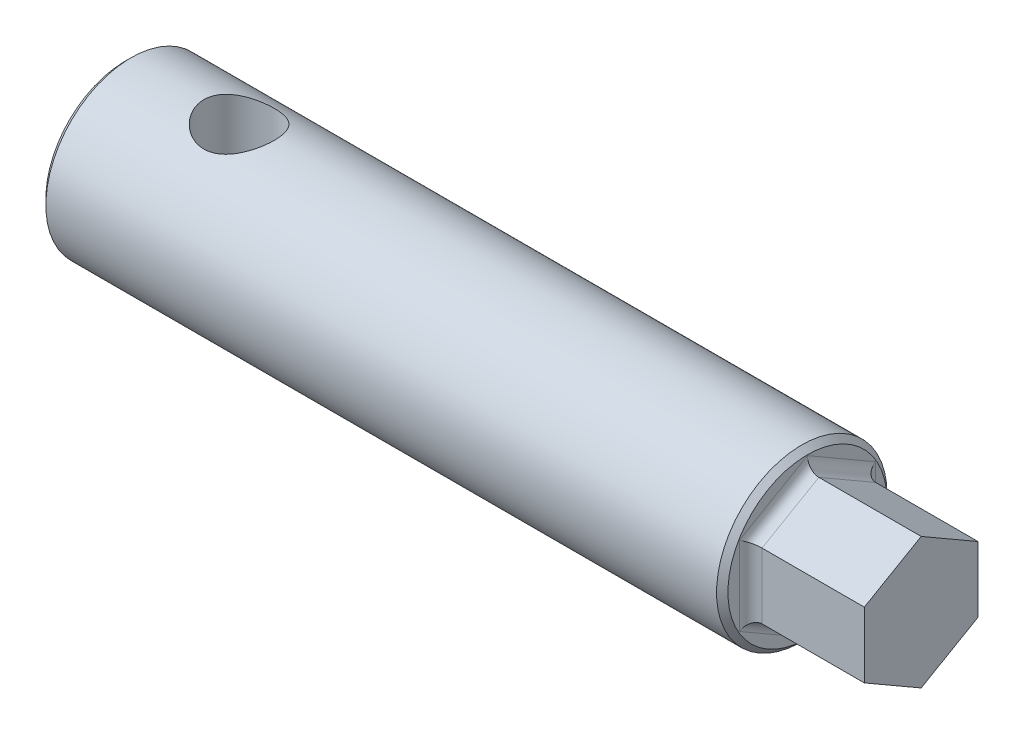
ISO-10303-21;
HEADER;
FILE_DESCRIPTION(('STEP AP214'),'2;1');
FILE_NAME('part.step','',(''),(''),'','','');
FILE_SCHEMA(('AUTOMOTIVE_DESIGN { 1 0 10303 214 1 1 1 1 }'));
ENDSEC;
DATA;
#1=APPLICATION_CONTEXT('core data for automotive mechanical design processes');
#2=APPLICATION_PROTOCOL_DEFINITION('international standard','automotive_design',2000,#1);
#3=PRODUCT_CONTEXT('',#1,'mechanical');
#4=PRODUCT('Part','Part','',(#3));
#5=PRODUCT_RELATED_PRODUCT_CATEGORY('part','',(#4));
#6=PRODUCT_DEFINITION_FORMATION('','',#4);
#7=PRODUCT_DEFINITION_CONTEXT('part definition',#1,'design');
#8=PRODUCT_DEFINITION('design','',#6,#7);
#9=PRODUCT_DEFINITION_SHAPE('','',#8);
#10=(LENGTH_UNIT() NAMED_UNIT(*) SI_UNIT(.MILLI.,.METRE.));
#11=(NAMED_UNIT(*) PLANE_ANGLE_UNIT() SI_UNIT($,.RADIAN.));
#12=(NAMED_UNIT(*) SI_UNIT($,.STERADIAN.) SOLID_ANGLE_UNIT());
#13=UNCERTAINTY_MEASURE_WITH_UNIT(LENGTH_MEASURE(1.E-05),#10,'distance_accuracy_value','');
#14=(GEOMETRIC_REPRESENTATION_CONTEXT(3) GLOBAL_UNCERTAINTY_ASSIGNED_CONTEXT((#13)) GLOBAL_UNIT_ASSIGNED_CONTEXT((#10,
#11,#12)) REPRESENTATION_CONTEXT('',''));
#15=CARTESIAN_POINT('',(0.,0.,0.));
#16=DIRECTION('',(0.,0.,1.));
#17=DIRECTION('',(1.,0.,0.));
#18=AXIS2_PLACEMENT_3D('',#15,#16,#17);
#19=CARTESIAN_POINT('',(60.,0.,0.));
#20=DIRECTION('',(1.,0.,0.));
#21=DIRECTION('',(0.,0.,-1.));
#22=AXIS2_PLACEMENT_3D('',#19,#20,#21);
#23=PLANE('',#22);
#24=CARTESIAN_POINT('',(60.,0.,0.));
#25=DIRECTION('',(1.,0.,0.));
#26=DIRECTION('',(0.,0.,-1.));
#27=AXIS2_PLACEMENT_3D('',#24,#25,#26);
#28=CIRCLE('',#27,7.00000000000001);
#29=CARTESIAN_POINT('',(60.,0.,-7.00000000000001));
#30=VERTEX_POINT('',#29);
#31=EDGE_CURVE('E173',#30,#30,#28,.T.);
#32=ORIENTED_EDGE('',*,*,#31,.T.);
#33=EDGE_LOOP('',(#32));
#34=FACE_BOUND('',#33,.T.);
#35=DIRECTION('',(0.,-0.5,-0.866025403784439));
#36=VECTOR('',#35,1.);
#37=CARTESIAN_POINT('',(60.,-5.19615242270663,3.));
#38=LINE('',#37,#36);
#39=CARTESIAN_POINT('',(60.,-6.92820323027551,0.));
#40=VERTEX_POINT('',#39);
#41=CARTESIAN_POINT('',(60.,-3.46410161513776,6.));
#42=VERTEX_POINT('',#41);
#43=EDGE_CURVE('E205',#40,#42,#38,.F.);
#44=ORIENTED_EDGE('',*,*,#43,.T.);
#45=DIRECTION('',(0.,-1.,0.));
#46=VECTOR('',#45,1.);
#47=CARTESIAN_POINT('',(60.,0.,6.));
#48=LINE('',#47,#46);
#49=CARTESIAN_POINT('',(60.,3.46410161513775,6.));
#50=VERTEX_POINT('',#49);
#51=EDGE_CURVE('E202',#42,#50,#48,.F.);
#52=ORIENTED_EDGE('',*,*,#51,.T.);
#53=DIRECTION('',(0.,-0.5,0.866025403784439));
#54=VECTOR('',#53,1.);
#55=CARTESIAN_POINT('',(60.,5.19615242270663,3.));
#56=LINE('',#55,#54);
#57=CARTESIAN_POINT('',(60.,6.92820323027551,0.));
#58=VERTEX_POINT('',#57);
#59=EDGE_CURVE('E213',#50,#58,#56,.F.);
#60=ORIENTED_EDGE('',*,*,#59,.T.);
#61=DIRECTION('',(0.,0.5,0.866025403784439));
#62=VECTOR('',#61,1.);
#63=CARTESIAN_POINT('',(60.,5.19615242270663,-3.));
#64=LINE('',#63,#62);
#65=CARTESIAN_POINT('',(60.,3.46410161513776,-6.));
#66=VERTEX_POINT('',#65);
#67=EDGE_CURVE('E211',#58,#66,#64,.F.);
#68=ORIENTED_EDGE('',*,*,#67,.T.);
#69=DIRECTION('',(0.,1.,0.));
#70=VECTOR('',#69,1.);
#71=CARTESIAN_POINT('',(60.,0.,-6.));
#72=LINE('',#71,#70);
#73=CARTESIAN_POINT('',(60.,-3.46410161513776,-6.));
#74=VERTEX_POINT('',#73);
#75=EDGE_CURVE('E209',#66,#74,#72,.F.);
#76=ORIENTED_EDGE('',*,*,#75,.T.);
#77=DIRECTION('',(0.,0.5,-0.866025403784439));
#78=VECTOR('',#77,1.);
#79=CARTESIAN_POINT('',(60.,-5.19615242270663,-3.));
#80=LINE('',#79,#78);
#81=EDGE_CURVE('E207',#74,#40,#80,.F.);
#82=ORIENTED_EDGE('',*,*,#81,.T.);
#83=EDGE_LOOP('',(#44,#52,#60,#68,#76,#82));
#84=FACE_BOUND('',#83,.T.);
#85=ADVANCED_FACE('F35',(#34,#84),#23,.T.);
#86=CARTESIAN_POINT('',(60.,0.,0.));
#87=DIRECTION('',(-1.,0.,0.));
#88=DIRECTION('',(0.,0.,1.));
#89=AXIS2_PLACEMENT_3D('',#86,#87,#88);
#90=CYLINDRICAL_SURFACE('',#89,7.5);
#91=CARTESIAN_POINT('',(59.5,0.,0.));
#92=DIRECTION('',(1.,0.,0.));
#93=DIRECTION('',(0.,0.,-1.));
#94=AXIS2_PLACEMENT_3D('',#91,#92,#93);
#95=CIRCLE('',#94,7.5);
#96=CARTESIAN_POINT('',(59.5,0.,-7.5));
#97=VERTEX_POINT('',#96);
#98=EDGE_CURVE('E43',#97,#97,#95,.F.);
#99=ORIENTED_EDGE('',*,*,#98,.T.);
#100=EDGE_LOOP('',(#99));
#101=FACE_BOUND('',#100,.T.);
#102=CARTESIAN_POINT('',(0.500000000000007,0.,0.));
#103=DIRECTION('',(1.,0.,0.));
#104=DIRECTION('',(0.,0.,-1.));
#105=AXIS2_PLACEMENT_3D('',#102,#103,#104);
#106=CIRCLE('',#105,7.5);
#107=CARTESIAN_POINT('',(0.500000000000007,0.,-7.5));
#108=VERTEX_POINT('',#107);
#109=EDGE_CURVE('E171',#108,#108,#106,.T.);
#110=ORIENTED_EDGE('',*,*,#109,.T.);
#111=EDGE_LOOP('',(#110));
#112=FACE_BOUND('',#111,.T.);
#113=CARTESIAN_POINT('',(6.90000000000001,-7.5,0.));
#114=CARTESIAN_POINT('',(6.9000064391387,-7.49999499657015,0.166153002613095));
#115=CARTESIAN_POINT('',(6.91343710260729,-7.49441556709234,0.332600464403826));
#116=CARTESIAN_POINT('',(6.96665945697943,-7.47265556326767,0.660768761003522));
#117=CARTESIAN_POINT('',(7.00652053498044,-7.4564470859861,0.82247598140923));
#118=CARTESIAN_POINT('',(7.11089783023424,-7.41516232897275,1.13589928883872));
#119=CARTESIAN_POINT('',(7.17533108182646,-7.39011591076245,1.28764700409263));
#120=CARTESIAN_POINT('',(7.32668057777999,-7.33360222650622,1.57803340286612));
#121=CARTESIAN_POINT('',(7.4135898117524,-7.30213696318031,1.71667615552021));
#122=CARTESIAN_POINT('',(7.61197764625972,-7.23419554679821,1.98400959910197));
#123=CARTESIAN_POINT('',(7.724390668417,-7.19755699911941,2.11196525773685));
#124=CARTESIAN_POINT('',(7.96861992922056,-7.12411042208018,2.34783768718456));
#125=CARTESIAN_POINT('',(8.1004461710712,-7.08730231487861,2.45574406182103));
#126=CARTESIAN_POINT('',(8.38747140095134,-7.01570032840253,2.6535947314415));
#127=CARTESIAN_POINT('',(8.54349109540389,-6.98108925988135,2.74242148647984));
#128=CARTESIAN_POINT('',(8.86989674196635,-6.9203697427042,2.89224243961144));
#129=CARTESIAN_POINT('',(9.04027535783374,-6.89425698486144,2.9532507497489));
#130=CARTESIAN_POINT('',(9.3821040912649,-6.8552453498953,3.04268024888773));
#131=CARTESIAN_POINT('',(9.55311693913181,-6.84177651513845,3.07251470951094));
#132=CARTESIAN_POINT('',(9.89821105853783,-6.82793602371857,3.10316007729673));
#133=CARTESIAN_POINT('',(10.0722906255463,-6.82755730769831,3.10398662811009));
#134=CARTESIAN_POINT('',(10.4046031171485,-6.83945669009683,3.07765851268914));
#135=CARTESIAN_POINT('',(10.5630431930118,-6.85078502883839,3.05260360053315));
#136=CARTESIAN_POINT('',(10.8732281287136,-6.88321931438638,2.97874158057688));
#137=CARTESIAN_POINT('',(11.0249717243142,-6.90432709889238,2.92993000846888));
#138=CARTESIAN_POINT('',(11.32125495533,-6.95441629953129,2.80899254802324));
#139=CARTESIAN_POINT('',(11.4655748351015,-6.98355455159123,2.73639615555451));
#140=CARTESIAN_POINT('',(11.7405392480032,-7.04638370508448,2.57028194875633));
#141=CARTESIAN_POINT('',(11.8711784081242,-7.0800763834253,2.47675595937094));
#142=CARTESIAN_POINT('',(12.1264901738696,-7.15162260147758,2.26231791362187));
#143=CARTESIAN_POINT('',(12.2497665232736,-7.18958932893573,2.13977666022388));
#144=CARTESIAN_POINT('',(12.4744833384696,-7.26304146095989,1.87537753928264));
#145=CARTESIAN_POINT('',(12.5759188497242,-7.29852630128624,1.73351530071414));
#146=CARTESIAN_POINT('',(12.7560777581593,-7.3640172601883,1.4303156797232));
#147=CARTESIAN_POINT('',(12.8342419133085,-7.3938829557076,1.26861343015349));
#148=CARTESIAN_POINT('',(12.9617700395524,-7.44369617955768,0.932805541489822));
#149=CARTESIAN_POINT('',(13.0111496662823,-7.46364909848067,0.758706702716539));
#150=CARTESIAN_POINT('',(13.0768047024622,-7.49038660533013,0.414723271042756));
#151=CARTESIAN_POINT('',(13.0949544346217,-7.49791555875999,0.245254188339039));
#152=CARTESIAN_POINT('',(13.103211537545,-7.50132646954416,-0.0944609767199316));
#153=CARTESIAN_POINT('',(13.0933267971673,-7.4972117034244,-0.264706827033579));
#154=CARTESIAN_POINT('',(13.0471450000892,-7.4782813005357,-0.592423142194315));
#155=CARTESIAN_POINT('',(13.0121566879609,-7.46399615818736,-0.750112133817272));
#156=CARTESIAN_POINT('',(12.9185741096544,-7.42672470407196,-1.05721523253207));
#157=CARTESIAN_POINT('',(12.8599768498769,-7.40373728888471,-1.20662828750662));
#158=CARTESIAN_POINT('',(12.7189243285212,-7.35038535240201,-1.49816127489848));
#159=CARTESIAN_POINT('',(12.6357859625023,-7.31981428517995,-1.63991168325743));
#160=CARTESIAN_POINT('',(12.4487631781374,-7.25456871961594,-1.90795528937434));
#161=CARTESIAN_POINT('',(12.3448701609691,-7.21989252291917,-2.03424204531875));
#162=CARTESIAN_POINT('',(12.11072920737,-7.14716389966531,-2.27711097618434));
#163=CARTESIAN_POINT('',(11.9791411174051,-7.10904560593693,-2.3923848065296));
#164=CARTESIAN_POINT('',(11.6978661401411,-7.03593167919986,-2.59957048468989));
#165=CARTESIAN_POINT('',(11.5481753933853,-7.00093671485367,-2.69147733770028));
#166=CARTESIAN_POINT('',(11.2320308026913,-6.93784170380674,-2.85022442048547));
#167=CARTESIAN_POINT('',(11.0653808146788,-6.90983935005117,-2.91671570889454));
#168=CARTESIAN_POINT('',(10.7217315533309,-6.86527482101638,-3.02013779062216));
#169=CARTESIAN_POINT('',(10.5447407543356,-6.84870341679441,-3.05709243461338));
#170=CARTESIAN_POINT('',(10.1999264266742,-6.83027124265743,-3.09804010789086));
#171=CARTESIAN_POINT('',(10.0324282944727,-6.82738831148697,-3.10432447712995));
#172=CARTESIAN_POINT('',(9.69886806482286,-6.8339513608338,-3.08985007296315));
#173=CARTESIAN_POINT('',(9.53280575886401,-6.84339551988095,-3.06909529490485));
#174=CARTESIAN_POINT('',(9.21453656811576,-6.87262082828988,-3.00304618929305));
#175=CARTESIAN_POINT('',(9.06204255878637,-6.89191674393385,-2.95890039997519));
#176=CARTESIAN_POINT('',(8.76658499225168,-6.93829866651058,-2.84843476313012));
#177=CARTESIAN_POINT('',(8.62362411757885,-6.96538685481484,-2.78210870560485));
#178=CARTESIAN_POINT('',(8.34199859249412,-7.0263027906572,-2.62461324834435));
#179=CARTESIAN_POINT('',(8.20409737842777,-7.06043592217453,-2.53219913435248));
#180=CARTESIAN_POINT('',(7.94504024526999,-7.13072826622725,-2.32690149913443));
#181=CARTESIAN_POINT('',(7.82389000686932,-7.16688816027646,-2.21401106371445));
#182=CARTESIAN_POINT('',(7.59291615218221,-7.24024921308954,-1.9614498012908));
#183=CARTESIAN_POINT('',(7.48451275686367,-7.2773412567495,-1.82044465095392));
#184=CARTESIAN_POINT('',(7.29281265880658,-7.34580237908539,-1.52076323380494));
#185=CARTESIAN_POINT('',(7.20952743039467,-7.37716883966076,-1.36207893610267));
#186=CARTESIAN_POINT('',(7.10636194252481,-7.4170196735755,-1.11564028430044));
#187=CARTESIAN_POINT('',(7.07576258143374,-7.42903456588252,-1.03279444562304));
#188=CARTESIAN_POINT('',(7.02167325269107,-7.45049041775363,-0.8645026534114));
#189=CARTESIAN_POINT('',(6.99817992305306,-7.45993259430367,-0.779057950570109));
#190=CARTESIAN_POINT('',(6.95860916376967,-7.4759436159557,-0.606439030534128));
#191=CARTESIAN_POINT('',(6.94251335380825,-7.48251958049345,-0.519269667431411));
#192=CARTESIAN_POINT('',(6.91784408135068,-7.49263353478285,-0.343742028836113));
#193=CARTESIAN_POINT('',(6.90926506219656,-7.49617376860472,-0.255384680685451));
#194=CARTESIAN_POINT('',(6.90299494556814,-7.49876251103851,-0.139047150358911));
#195=CARTESIAN_POINT('',(6.90187232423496,-7.4992261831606,-0.111252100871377));
#196=CARTESIAN_POINT('',(6.900374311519,-7.4998453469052,-0.0556407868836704));
#197=CARTESIAN_POINT('',(6.8999989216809,-7.50000083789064,-0.0278245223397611));
#198=CARTESIAN_POINT('',(6.90000000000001,-7.5,0.));
#199=B_SPLINE_CURVE_WITH_KNOTS('',3,(#113,#114,#115,#116,#117,#118,#119,#120,#121,#122,#123,
#124,#125,#126,#127,#128,#129,#130,#131,#132,#133,#134,#135,#136,#137,#138,#139,#140,#141,#142,
#143,#144,#145,#146,#147,#148,#149,#150,#151,#152,#153,#154,#155,#156,#157,#158,#159,#160,#161,
#162,#163,#164,#165,#166,#167,#168,#169,#170,#171,#172,#173,#174,#175,#176,#177,#178,#179,#180,
#181,#182,#183,#184,#185,#186,#187,#188,#189,#190,#191,#192,#193,#194,#195,#196,#197,#198),
.UNSPECIFIED.,.T.,.F.,(4,2,2,2,2,2,2,2,2,2,2,2,2,2,2,2,2,2,2,2,2,2,2,2,2,2,2,2,2,2,2,2,2,2,2,2,
2,2,2,2,2,2,4),(0.,0.498350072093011,0.998013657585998,1.49600490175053,1.9938410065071,
2.51422237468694,3.03487282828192,3.58063836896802,4.12612673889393,4.64564263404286,
5.16487835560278,5.64506306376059,6.12533804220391,6.61575367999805,7.10636120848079,
7.63770794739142,8.1691750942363,8.71253919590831,9.25560749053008,9.7647703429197,
10.2737899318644,10.758038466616,11.2423484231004,11.7416676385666,12.2411941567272,
12.7758736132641,13.310667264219,13.8525600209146,14.3940147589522,14.8943247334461,
15.394560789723,15.8722439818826,16.3500610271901,16.8563461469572,17.3628025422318,
17.9053115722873,18.448068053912,18.7151630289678,18.9821314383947,19.2484328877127,
19.5145373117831,19.5979924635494,19.6814477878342),.UNSPECIFIED.);
#200=CARTESIAN_POINT('',(6.90000000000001,-7.5,0.));
#201=VERTEX_POINT('',#200);
#202=EDGE_CURVE('E130',#201,#201,#199,.T.);
#203=ORIENTED_EDGE('',*,*,#202,.T.);
#204=EDGE_LOOP('',(#203));
#205=FACE_BOUND('',#204,.T.);
#206=CARTESIAN_POINT('',(10.,6.82934843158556,3.09999999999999));
#207=CARTESIAN_POINT('',(9.91722245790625,6.82934923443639,3.0999991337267));
#208=CARTESIAN_POINT('',(9.83441066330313,6.83086031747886,3.09667737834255));
#209=CARTESIAN_POINT('',(9.66940840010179,6.83684598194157,3.08343625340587));
#210=CARTESIAN_POINT('',(9.58721838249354,6.84132253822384,3.07351248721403));
#211=CARTESIAN_POINT('',(9.34217754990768,6.8590304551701,3.03390998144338));
#212=CARTESIAN_POINT('',(9.18109830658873,6.87653945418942,2.99440038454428));
#213=CARTESIAN_POINT('',(8.86917105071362,6.9206142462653,2.89105204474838));
#214=CARTESIAN_POINT('',(8.71828463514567,6.94714347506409,2.82731140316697));
#215=CARTESIAN_POINT('',(8.42935413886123,7.00620610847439,2.67759871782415));
#216=CARTESIAN_POINT('',(8.29130688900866,7.03873802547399,2.59163218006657));
#217=CARTESIAN_POINT('',(8.02348574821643,7.10837126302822,2.39428077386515));
#218=CARTESIAN_POINT('',(7.89459633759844,7.14562598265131,2.2817499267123));
#219=CARTESIAN_POINT('',(7.65686360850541,7.21924466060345,2.03687154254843));
#220=CARTESIAN_POINT('',(7.54802794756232,7.25560827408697,1.90451647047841));
#221=CARTESIAN_POINT('',(7.34901381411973,7.32520673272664,1.61682826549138));
#222=CARTESIAN_POINT('',(7.25982662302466,7.35824252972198,1.46075688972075));
#223=CARTESIAN_POINT('',(7.1093542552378,7.41558987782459,1.13421441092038));
#224=CARTESIAN_POINT('',(7.0480568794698,7.43990524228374,0.963749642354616));
#225=CARTESIAN_POINT('',(6.95829787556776,7.47598489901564,0.622536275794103));
#226=CARTESIAN_POINT('',(6.92831288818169,7.48832914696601,0.452250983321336));
#227=CARTESIAN_POINT('',(6.89711086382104,7.50118024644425,0.108648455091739));
#228=CARTESIAN_POINT('',(6.89588235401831,7.50169181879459,-0.064667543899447));
#229=CARTESIAN_POINT('',(6.92142244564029,7.49116370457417,-0.398348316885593));
#230=CARTESIAN_POINT('',(6.94651823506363,7.48081418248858,-0.558866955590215));
#231=CARTESIAN_POINT('',(7.02113148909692,7.45067100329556,-0.873177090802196));
#232=CARTESIAN_POINT('',(7.07065075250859,7.43087665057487,-1.026968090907));
#233=CARTESIAN_POINT('',(7.19329874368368,7.38338252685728,-1.32627030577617));
#234=CARTESIAN_POINT('',(7.26677557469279,7.35556694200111,-1.47161973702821));
#235=CARTESIAN_POINT('',(7.43491505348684,7.29476009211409,-1.74830538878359));
#236=CARTESIAN_POINT('',(7.52958514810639,7.26176700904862,-1.87963665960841));
#237=CARTESIAN_POINT('',(7.74508118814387,7.1912165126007,-2.13425756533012));
#238=CARTESIAN_POINT('',(7.86726792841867,7.15350124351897,-2.25635345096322));
#239=CARTESIAN_POINT('',(8.1304802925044,7.07948928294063,-2.47883194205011));
#240=CARTESIAN_POINT('',(8.27151292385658,7.04319312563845,-2.57920643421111));
#241=CARTESIAN_POINT('',(8.57410718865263,6.97501268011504,-2.75838822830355));
#242=CARTESIAN_POINT('',(8.73618022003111,6.94330608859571,-2.8364053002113));
#243=CARTESIAN_POINT('',(9.07282292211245,6.89000396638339,-2.96355442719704));
#244=CARTESIAN_POINT('',(9.24738372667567,6.86840134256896,-3.01270675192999));
#245=CARTESIAN_POINT('',(9.59209478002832,6.83950438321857,-3.07772218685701));
#246=CARTESIAN_POINT('',(9.76180984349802,6.8313812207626,-3.09551817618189));
#247=CARTESIAN_POINT('',(10.1019589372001,6.82799500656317,-3.10298495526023));
#248=CARTESIAN_POINT('',(10.2723927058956,6.8327276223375,-3.09266522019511));
#249=CARTESIAN_POINT('',(10.5979118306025,6.85366452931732,-3.04595665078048));
#250=CARTESIAN_POINT('',(10.7532903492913,6.86913263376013,-3.01123908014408));
#251=CARTESIAN_POINT('',(11.0558941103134,6.90886244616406,-2.91892547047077));
#252=CARTESIAN_POINT('',(11.2031174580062,6.93312618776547,-2.86132414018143));
#253=CARTESIAN_POINT('',(11.4921405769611,6.98895623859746,-2.72218983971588));
#254=CARTESIAN_POINT('',(11.6334526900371,7.02078650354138,-2.63975317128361));
#255=CARTESIAN_POINT('',(11.9009099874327,7.08778250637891,-2.45419230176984));
#256=CARTESIAN_POINT('',(12.0270486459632,7.12294966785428,-2.35105925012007));
#257=CARTESIAN_POINT('',(12.271060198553,7.19604671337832,-2.11732152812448));
#258=CARTESIAN_POINT('',(12.3874684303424,7.23397293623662,-1.98518068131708));
#259=CARTESIAN_POINT('',(12.5967141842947,7.30569956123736,-1.70235557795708));
#260=CARTESIAN_POINT('',(12.6895501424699,7.33949968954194,-1.5516700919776));
#261=CARTESIAN_POINT('',(12.8488618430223,7.39936075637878,-1.23508298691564));
#262=CARTESIAN_POINT('',(12.9152856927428,7.42540643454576,-1.06915219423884));
#263=CARTESIAN_POINT('',(13.0188025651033,7.46665196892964,-0.727120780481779));
#264=CARTESIAN_POINT('',(13.0559127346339,7.48185816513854,-0.551026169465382));
#265=CARTESIAN_POINT('',(13.097614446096,7.49899271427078,-0.206769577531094));
#266=CARTESIAN_POINT('',(13.1042722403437,7.50176449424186,-0.0388981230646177));
#267=CARTESIAN_POINT('',(13.0904152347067,7.49604044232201,0.295505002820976));
#268=CARTESIAN_POINT('',(13.0699050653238,7.48754653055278,0.462036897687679));
#269=CARTESIAN_POINT('',(13.0037771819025,7.46068458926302,0.783119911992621));
#270=CARTESIAN_POINT('',(12.9590497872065,7.44266720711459,0.937886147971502));
#271=CARTESIAN_POINT('',(12.8467207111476,7.39872663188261,1.23766640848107));
#272=CARTESIAN_POINT('',(12.7791146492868,7.37280192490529,1.38267855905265));
#273=CARTESIAN_POINT('',(12.6195396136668,7.31411257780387,1.66602347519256));
#274=CARTESIAN_POINT('',(12.5266106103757,7.28109249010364,1.80376137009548));
#275=CARTESIAN_POINT('',(12.3204266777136,7.2121393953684,2.06227400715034));
#276=CARTESIAN_POINT('',(12.2071643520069,7.17620533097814,2.18304254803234));
#277=CARTESIAN_POINT('',(11.954635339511,7.10246810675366,2.41255822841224));
#278=CARTESIAN_POINT('',(11.8141372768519,7.06470035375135,2.51996424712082));
#279=CARTESIAN_POINT('',(11.5158204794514,6.99405559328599,2.70989055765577));
#280=CARTESIAN_POINT('',(11.3579922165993,6.9611812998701,2.79239706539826));
#281=CARTESIAN_POINT('',(11.1120208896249,6.91882000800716,2.89504349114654));
#282=CARTESIAN_POINT('',(11.0287159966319,6.90588211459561,2.92568866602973));
#283=CARTESIAN_POINT('',(10.8594553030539,6.88270703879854,2.97980108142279));
#284=CARTESIAN_POINT('',(10.7735008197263,6.87246853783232,3.0032718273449));
#285=CARTESIAN_POINT('',(10.5998311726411,6.85509645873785,3.04271521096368));
#286=CARTESIAN_POINT('',(10.5121213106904,6.84795467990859,3.05870766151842));
#287=CARTESIAN_POINT('',(10.3354881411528,6.83701670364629,3.08308020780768));
#288=CARTESIAN_POINT('',(10.2465658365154,6.83321789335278,3.09146624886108));
#289=CARTESIAN_POINT('',(10.1312303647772,6.83055865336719,3.097332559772));
#290=CARTESIAN_POINT('',(10.1049973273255,6.83010512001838,3.09833255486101));
#291=CARTESIAN_POINT('',(10.0525106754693,6.82949988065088,3.09966641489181));
#292=CARTESIAN_POINT('',(10.0262570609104,6.82934817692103,3.10000027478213));
#293=CARTESIAN_POINT('',(10.,6.82934843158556,3.09999999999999));
#294=B_SPLINE_CURVE_WITH_KNOTS('',3,(#206,#207,#208,#209,#210,#211,#212,#213,#214,#215,#216,
#217,#218,#219,#220,#221,#222,#223,#224,#225,#226,#227,#228,#229,#230,#231,#232,#233,#234,#235,
#236,#237,#238,#239,#240,#241,#242,#243,#244,#245,#246,#247,#248,#249,#250,#251,#252,#253,#254,
#255,#256,#257,#258,#259,#260,#261,#262,#263,#264,#265,#266,#267,#268,#269,#270,#271,#272,#273,
#274,#275,#276,#277,#278,#279,#280,#281,#282,#283,#284,#285,#286,#287,#288,#289,#290,#291,#292,
#293),.UNSPECIFIED.,.T.,.F.,(4,2,2,2,2,2,2,2,2,2,2,2,2,2,2,2,2,2,2,2,2,2,2,2,2,2,2,2,2,2,2,2,2,
2,2,2,2,2,2,2,2,2,2,4),(0.,0.248302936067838,0.49677139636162,0.994425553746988,1.490086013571,
1.98562380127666,2.50866580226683,3.03190711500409,3.57741929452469,4.12269263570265,
4.63998932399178,5.15707962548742,5.643192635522,6.12934145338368,6.62289469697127,
7.11662163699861,7.64467184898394,8.17291895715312,8.71801893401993,9.26273566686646,
9.77251591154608,10.2821243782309,10.7598518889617,11.23768992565,11.7356016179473,
12.2337266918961,12.7716336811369,13.3095763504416,13.8485707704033,14.387249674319,
14.8887764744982,15.3902178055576,15.8743651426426,16.3586052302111,16.8646520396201,
17.3708833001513,17.910916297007,18.4512477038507,18.7200482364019,18.9887172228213,
19.2566703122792,19.5244137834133,19.6031749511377,19.6819367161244),.UNSPECIFIED.);
#295=CARTESIAN_POINT('',(10.,6.82934843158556,3.09999999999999));
#296=VERTEX_POINT('',#295);
#297=EDGE_CURVE('E127',#296,#296,#294,.T.);
#298=ORIENTED_EDGE('',*,*,#297,.T.);
#299=EDGE_LOOP('',(#298));
#300=FACE_BOUND('',#299,.T.);
#301=ADVANCED_FACE('F143',(#101,#112,#205,#300),#90,.T.);
#302=CARTESIAN_POINT('',(0.,0.,0.));
#303=DIRECTION('',(1.,0.,0.));
#304=DIRECTION('',(0.,0.,-1.));
#305=AXIS2_PLACEMENT_3D('',#302,#303,#304);
#306=PLANE('',#305);
#307=CARTESIAN_POINT('',(0.,0.,0.));
#308=DIRECTION('',(1.,0.,0.));
#309=DIRECTION('',(0.,0.,-1.));
#310=AXIS2_PLACEMENT_3D('',#307,#308,#309);
#311=CIRCLE('',#310,6.99999999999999);
#312=CARTESIAN_POINT('',(0.,0.,-6.99999999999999));
#313=VERTEX_POINT('',#312);
#314=EDGE_CURVE('E11',#313,#313,#311,.F.);
#315=ORIENTED_EDGE('',*,*,#314,.T.);
#316=EDGE_LOOP('',(#315));
#317=FACE_BOUND('',#316,.T.);
#318=ADVANCED_FACE('F152',(#317),#306,.F.);
#319=CARTESIAN_POINT('',(10.,7.5,0.));
#320=DIRECTION('',(0.,1.,0.));
#321=DIRECTION('',(0.,0.,1.));
#322=AXIS2_PLACEMENT_3D('',#319,#320,#321);
#323=CYLINDRICAL_SURFACE('',#322,3.09999999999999);
#324=ORIENTED_EDGE('',*,*,#297,.F.);
#325=EDGE_LOOP('',(#324));
#326=FACE_BOUND('',#325,.T.);
#327=ORIENTED_EDGE('',*,*,#202,.F.);
#328=EDGE_LOOP('',(#327));
#329=FACE_BOUND('',#328,.T.);
#330=ADVANCED_FACE('F147',(#326,#329),#323,.F.);
#331=CARTESIAN_POINT('',(70.,2.88675134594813,-5.));
#332=DIRECTION('',(0.,-0.866025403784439,0.5));
#333=DIRECTION('',(0.,-0.5,-0.866025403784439));
#334=AXIS2_PLACEMENT_3D('',#331,#332,#333);
#335=PLANE('',#334);
#336=DIRECTION('',(-1.,0.,0.));
#337=VECTOR('',#336,1.);
#338=CARTESIAN_POINT('',(70.,2.88675134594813,-5.));
#339=LINE('',#338,#337);
#340=CARTESIAN_POINT('',(70.,2.88675134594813,-5.));
#341=VERTEX_POINT('',#340);
#342=CARTESIAN_POINT('',(61.,2.88675134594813,-5.));
#343=VERTEX_POINT('',#342);
#344=EDGE_CURVE('E241',#341,#343,#339,.T.);
#345=ORIENTED_EDGE('',*,*,#344,.T.);
#346=DIRECTION('',(0.,0.5,0.866025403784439));
#347=VECTOR('',#346,1.);
#348=CARTESIAN_POINT('',(61.,2.88675134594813,-5.));
#349=LINE('',#348,#347);
#350=CARTESIAN_POINT('',(61.,5.77350269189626,0.));
#351=VERTEX_POINT('',#350);
#352=EDGE_CURVE('E50',#343,#351,#349,.T.);
#353=ORIENTED_EDGE('',*,*,#352,.T.);
#354=DIRECTION('',(-1.,0.,0.));
#355=VECTOR('',#354,1.);
#356=CARTESIAN_POINT('',(70.,5.77350269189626,0.));
#357=LINE('',#356,#355);
#358=CARTESIAN_POINT('',(70.,5.77350269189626,0.));
#359=VERTEX_POINT('',#358);
#360=EDGE_CURVE('E111',#359,#351,#357,.T.);
#361=ORIENTED_EDGE('',*,*,#360,.F.);
#362=DIRECTION('',(0.,0.5,0.866025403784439));
#363=VECTOR('',#362,1.);
#364=CARTESIAN_POINT('',(70.,2.88675134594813,-5.));
#365=LINE('',#364,#363);
#366=EDGE_CURVE('E118',#341,#359,#365,.T.);
#367=ORIENTED_EDGE('',*,*,#366,.F.);
#368=EDGE_LOOP('',(#345,#353,#361,#367));
#369=FACE_BOUND('',#368,.T.);
#370=ADVANCED_FACE('F126',(#369),#335,.F.);
#371=CARTESIAN_POINT('',(70.,5.77350269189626,0.));
#372=DIRECTION('',(0.,-0.866025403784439,-0.5));
#373=DIRECTION('',(0.,0.5,-0.866025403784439));
#374=AXIS2_PLACEMENT_3D('',#371,#372,#373);
#375=PLANE('',#374);
#376=ORIENTED_EDGE('',*,*,#360,.T.);
#377=DIRECTION('',(0.,-0.5,0.866025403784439));
#378=VECTOR('',#377,1.);
#379=CARTESIAN_POINT('',(61.,5.77350269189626,0.));
#380=LINE('',#379,#378);
#381=CARTESIAN_POINT('',(61.,2.88675134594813,5.));
#382=VERTEX_POINT('',#381);
#383=EDGE_CURVE('E177',#351,#382,#380,.T.);
#384=ORIENTED_EDGE('',*,*,#383,.T.);
#385=DIRECTION('',(-1.,0.,0.));
#386=VECTOR('',#385,1.);
#387=CARTESIAN_POINT('',(70.,2.88675134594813,5.));
#388=LINE('',#387,#386);
#389=CARTESIAN_POINT('',(70.,2.88675134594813,5.));
#390=VERTEX_POINT('',#389);
#391=EDGE_CURVE('E114',#390,#382,#388,.T.);
#392=ORIENTED_EDGE('',*,*,#391,.F.);
#393=DIRECTION('',(0.,-0.5,0.866025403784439));
#394=VECTOR('',#393,1.);
#395=CARTESIAN_POINT('',(70.,5.77350269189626,0.));
#396=LINE('',#395,#394);
#397=EDGE_CURVE('E108',#359,#390,#396,.T.);
#398=ORIENTED_EDGE('',*,*,#397,.F.);
#399=EDGE_LOOP('',(#376,#384,#392,#398));
#400=FACE_BOUND('',#399,.T.);
#401=ADVANCED_FACE('F110',(#400),#375,.F.);
#402=CARTESIAN_POINT('',(70.,2.88675134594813,5.));
#403=DIRECTION('',(0.,0.,-1.));
#404=DIRECTION('',(0.,1.,0.));
#405=AXIS2_PLACEMENT_3D('',#402,#403,#404);
#406=PLANE('',#405);
#407=ORIENTED_EDGE('',*,*,#391,.T.);
#408=DIRECTION('',(0.,-1.,0.));
#409=VECTOR('',#408,1.);
#410=CARTESIAN_POINT('',(61.,2.88675134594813,5.));
#411=LINE('',#410,#409);
#412=CARTESIAN_POINT('',(61.,-2.88675134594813,5.));
#413=VERTEX_POINT('',#412);
#414=EDGE_CURVE('E214',#382,#413,#411,.T.);
#415=ORIENTED_EDGE('',*,*,#414,.T.);
#416=DIRECTION('',(-1.,0.,0.));
#417=VECTOR('',#416,1.);
#418=CARTESIAN_POINT('',(70.,-2.88675134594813,5.));
#419=LINE('',#418,#417);
#420=CARTESIAN_POINT('',(70.,-2.88675134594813,5.));
#421=VERTEX_POINT('',#420);
#422=EDGE_CURVE('E132',#421,#413,#419,.T.);
#423=ORIENTED_EDGE('',*,*,#422,.F.);
#424=DIRECTION('',(0.,-1.,0.));
#425=VECTOR('',#424,1.);
#426=CARTESIAN_POINT('',(70.,2.88675134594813,5.));
#427=LINE('',#426,#425);
#428=EDGE_CURVE('E117',#390,#421,#427,.T.);
#429=ORIENTED_EDGE('',*,*,#428,.F.);
#430=EDGE_LOOP('',(#407,#415,#423,#429));
#431=FACE_BOUND('',#430,.T.);
#432=ADVANCED_FACE('F226',(#431),#406,.F.);
#433=CARTESIAN_POINT('',(70.,-2.88675134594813,5.));
#434=DIRECTION('',(0.,0.866025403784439,-0.5));
#435=DIRECTION('',(0.,0.5,0.866025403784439));
#436=AXIS2_PLACEMENT_3D('',#433,#434,#435);
#437=PLANE('',#436);
#438=ORIENTED_EDGE('',*,*,#422,.T.);
#439=DIRECTION('',(0.,-0.5,-0.866025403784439));
#440=VECTOR('',#439,1.);
#441=CARTESIAN_POINT('',(61.,-2.88675134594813,5.));
#442=LINE('',#441,#440);
#443=CARTESIAN_POINT('',(61.,-5.77350269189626,0.));
#444=VERTEX_POINT('',#443);
#445=EDGE_CURVE('E200',#413,#444,#442,.T.);
#446=ORIENTED_EDGE('',*,*,#445,.T.);
#447=DIRECTION('',(-1.,0.,0.));
#448=VECTOR('',#447,1.);
#449=CARTESIAN_POINT('',(70.,-5.77350269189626,0.));
#450=LINE('',#449,#448);
#451=CARTESIAN_POINT('',(70.,-5.77350269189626,0.));
#452=VERTEX_POINT('',#451);
#453=EDGE_CURVE('E236',#452,#444,#450,.T.);
#454=ORIENTED_EDGE('',*,*,#453,.F.);
#455=DIRECTION('',(0.,-0.5,-0.866025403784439));
#456=VECTOR('',#455,1.);
#457=CARTESIAN_POINT('',(70.,-2.88675134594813,5.));
#458=LINE('',#457,#456);
#459=EDGE_CURVE('E235',#421,#452,#458,.T.);
#460=ORIENTED_EDGE('',*,*,#459,.F.);
#461=EDGE_LOOP('',(#438,#446,#454,#460));
#462=FACE_BOUND('',#461,.T.);
#463=ADVANCED_FACE('F231',(#462),#437,.F.);
#464=CARTESIAN_POINT('',(70.,-5.77350269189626,0.));
#465=DIRECTION('',(0.,0.866025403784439,0.5));
#466=DIRECTION('',(0.,-0.5,0.866025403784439));
#467=AXIS2_PLACEMENT_3D('',#464,#465,#466);
#468=PLANE('',#467);
#469=ORIENTED_EDGE('',*,*,#453,.T.);
#470=DIRECTION('',(0.,0.5,-0.866025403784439));
#471=VECTOR('',#470,1.);
#472=CARTESIAN_POINT('',(61.,-5.77350269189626,0.));
#473=LINE('',#472,#471);
#474=CARTESIAN_POINT('',(61.,-2.88675134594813,-5.));
#475=VERTEX_POINT('',#474);
#476=EDGE_CURVE('E198',#444,#475,#473,.T.);
#477=ORIENTED_EDGE('',*,*,#476,.T.);
#478=DIRECTION('',(-1.,0.,0.));
#479=VECTOR('',#478,1.);
#480=CARTESIAN_POINT('',(70.,-2.88675134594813,-5.));
#481=LINE('',#480,#479);
#482=CARTESIAN_POINT('',(70.,-2.88675134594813,-5.));
#483=VERTEX_POINT('',#482);
#484=EDGE_CURVE('E237',#483,#475,#481,.T.);
#485=ORIENTED_EDGE('',*,*,#484,.F.);
#486=DIRECTION('',(0.,0.5,-0.866025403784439));
#487=VECTOR('',#486,1.);
#488=CARTESIAN_POINT('',(70.,-5.77350269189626,0.));
#489=LINE('',#488,#487);
#490=EDGE_CURVE('E244',#452,#483,#489,.T.);
#491=ORIENTED_EDGE('',*,*,#490,.F.);
#492=EDGE_LOOP('',(#469,#477,#485,#491));
#493=FACE_BOUND('',#492,.T.);
#494=ADVANCED_FACE('F251',(#493),#468,.F.);
#495=CARTESIAN_POINT('',(70.,-2.88675134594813,-5.));
#496=DIRECTION('',(0.,0.,1.));
#497=DIRECTION('',(0.,-1.,0.));
#498=AXIS2_PLACEMENT_3D('',#495,#496,#497);
#499=PLANE('',#498);
#500=ORIENTED_EDGE('',*,*,#484,.T.);
#501=DIRECTION('',(0.,1.,0.));
#502=VECTOR('',#501,1.);
#503=CARTESIAN_POINT('',(61.,-2.88675134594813,-5.));
#504=LINE('',#503,#502);
#505=EDGE_CURVE('E58',#475,#343,#504,.T.);
#506=ORIENTED_EDGE('',*,*,#505,.T.);
#507=ORIENTED_EDGE('',*,*,#344,.F.);
#508=DIRECTION('',(0.,1.,0.));
#509=VECTOR('',#508,1.);
#510=CARTESIAN_POINT('',(70.,-2.88675134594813,-5.));
#511=LINE('',#510,#509);
#512=EDGE_CURVE('E123',#483,#341,#511,.T.);
#513=ORIENTED_EDGE('',*,*,#512,.F.);
#514=EDGE_LOOP('',(#500,#506,#507,#513));
#515=FACE_BOUND('',#514,.T.);
#516=ADVANCED_FACE('F252',(#515),#499,.F.);
#517=CARTESIAN_POINT('',(70.,5.77350269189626,0.));
#518=DIRECTION('',(1.,0.,0.));
#519=DIRECTION('',(0.,0.,-1.));
#520=AXIS2_PLACEMENT_3D('',#517,#518,#519);
#521=PLANE('',#520);
#522=ORIENTED_EDGE('',*,*,#366,.T.);
#523=ORIENTED_EDGE('',*,*,#397,.T.);
#524=ORIENTED_EDGE('',*,*,#428,.T.);
#525=ORIENTED_EDGE('',*,*,#459,.T.);
#526=ORIENTED_EDGE('',*,*,#490,.T.);
#527=ORIENTED_EDGE('',*,*,#512,.T.);
#528=EDGE_LOOP('',(#522,#523,#524,#525,#526,#527));
#529=FACE_BOUND('',#528,.T.);
#530=ADVANCED_FACE('F121',(#529),#521,.T.);
#531=CARTESIAN_POINT('',(61.,-2.88675134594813,-6.));
#532=DIRECTION('',(0.,1.,0.));
#533=DIRECTION('',(0.,0.,1.));
#534=AXIS2_PLACEMENT_3D('',#531,#532,#533);
#535=CYLINDRICAL_SURFACE('',#534,1.);
#536=CARTESIAN_POINT('',(61.,-3.46410161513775,-6.));
#537=DIRECTION('',(0.,0.866025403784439,-0.5));
#538=DIRECTION('',(0.,0.5,0.866025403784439));
#539=AXIS2_PLACEMENT_3D('',#536,#537,#538);
#540=ELLIPSE('',#539,1.15470053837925,1.);
#541=EDGE_CURVE('E182',#74,#475,#540,.T.);
#542=ORIENTED_EDGE('',*,*,#541,.F.);
#543=ORIENTED_EDGE('',*,*,#75,.F.);
#544=CARTESIAN_POINT('',(61.,3.46410161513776,-6.));
#545=DIRECTION('',(0.,0.866025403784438,0.500000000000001));
#546=DIRECTION('',(0.,-0.5,0.866025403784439));
#547=AXIS2_PLACEMENT_3D('',#544,#545,#546);
#548=ELLIPSE('',#547,1.15470053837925,1.);
#549=EDGE_CURVE('E124',#343,#66,#548,.F.);
#550=ORIENTED_EDGE('',*,*,#549,.F.);
#551=ORIENTED_EDGE('',*,*,#505,.F.);
#552=EDGE_LOOP('',(#542,#543,#550,#551));
#553=FACE_BOUND('',#552,.T.);
#554=ADVANCED_FACE('F257',(#553),#535,.F.);
#555=CARTESIAN_POINT('',(61.,3.75277674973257,-5.5));
#556=DIRECTION('',(0.,0.5,0.866025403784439));
#557=DIRECTION('',(0.,-0.866025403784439,0.5));
#558=AXIS2_PLACEMENT_3D('',#555,#556,#557);
#559=CYLINDRICAL_SURFACE('',#558,1.);
#560=ORIENTED_EDGE('',*,*,#549,.T.);
#561=ORIENTED_EDGE('',*,*,#67,.F.);
#562=CARTESIAN_POINT('',(61.,6.92820323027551,0.));
#563=DIRECTION('',(0.,0.,1.));
#564=DIRECTION('',(0.,-1.,0.));
#565=AXIS2_PLACEMENT_3D('',#562,#563,#564);
#566=ELLIPSE('',#565,1.15470053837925,1.);
#567=EDGE_CURVE('E185',#351,#58,#566,.F.);
#568=ORIENTED_EDGE('',*,*,#567,.F.);
#569=ORIENTED_EDGE('',*,*,#352,.F.);
#570=EDGE_LOOP('',(#560,#561,#568,#569));
#571=FACE_BOUND('',#570,.T.);
#572=ADVANCED_FACE('F260',(#571),#559,.F.);
#573=CARTESIAN_POINT('',(61.,-6.6395280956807,-0.500000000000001));
#574=DIRECTION('',(0.,0.5,-0.866025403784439));
#575=DIRECTION('',(0.,0.866025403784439,0.5));
#576=AXIS2_PLACEMENT_3D('',#573,#574,#575);
#577=CYLINDRICAL_SURFACE('',#576,1.);
#578=ORIENTED_EDGE('',*,*,#541,.T.);
#579=ORIENTED_EDGE('',*,*,#476,.F.);
#580=CARTESIAN_POINT('',(61.,-6.92820323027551,0.));
#581=DIRECTION('',(0.,0.,-1.));
#582=DIRECTION('',(0.,1.,0.));
#583=AXIS2_PLACEMENT_3D('',#580,#581,#582);
#584=ELLIPSE('',#583,1.15470053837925,1.);
#585=EDGE_CURVE('E188',#40,#444,#584,.T.);
#586=ORIENTED_EDGE('',*,*,#585,.F.);
#587=ORIENTED_EDGE('',*,*,#81,.F.);
#588=EDGE_LOOP('',(#578,#579,#586,#587));
#589=FACE_BOUND('',#588,.T.);
#590=ADVANCED_FACE('F275',(#589),#577,.F.);
#591=CARTESIAN_POINT('',(61.,6.6395280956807,0.500000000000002));
#592=DIRECTION('',(0.,-0.5,0.866025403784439));
#593=DIRECTION('',(0.,-0.866025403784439,-0.5));
#594=AXIS2_PLACEMENT_3D('',#591,#592,#593);
#595=CYLINDRICAL_SURFACE('',#594,1.);
#596=ORIENTED_EDGE('',*,*,#567,.T.);
#597=ORIENTED_EDGE('',*,*,#59,.F.);
#598=CARTESIAN_POINT('',(61.,3.46410161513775,6.));
#599=DIRECTION('',(0.,-0.866025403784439,0.5));
#600=DIRECTION('',(0.,0.5,0.866025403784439));
#601=AXIS2_PLACEMENT_3D('',#598,#599,#600);
#602=ELLIPSE('',#601,1.15470053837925,1.);
#603=EDGE_CURVE('E191',#382,#50,#602,.F.);
#604=ORIENTED_EDGE('',*,*,#603,.F.);
#605=ORIENTED_EDGE('',*,*,#383,.F.);
#606=EDGE_LOOP('',(#596,#597,#604,#605));
#607=FACE_BOUND('',#606,.T.);
#608=ADVANCED_FACE('F264',(#607),#595,.F.);
#609=CARTESIAN_POINT('',(61.,-3.75277674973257,5.5));
#610=DIRECTION('',(0.,-0.5,-0.866025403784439));
#611=DIRECTION('',(0.,0.866025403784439,-0.5));
#612=AXIS2_PLACEMENT_3D('',#609,#610,#611);
#613=CYLINDRICAL_SURFACE('',#612,1.);
#614=ORIENTED_EDGE('',*,*,#585,.T.);
#615=ORIENTED_EDGE('',*,*,#445,.F.);
#616=CARTESIAN_POINT('',(61.,-3.46410161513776,6.));
#617=DIRECTION('',(0.,-0.866025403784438,-0.5));
#618=DIRECTION('',(0.,0.5,-0.866025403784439));
#619=AXIS2_PLACEMENT_3D('',#616,#617,#618);
#620=ELLIPSE('',#619,1.15470053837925,1.);
#621=EDGE_CURVE('E193',#42,#413,#620,.T.);
#622=ORIENTED_EDGE('',*,*,#621,.F.);
#623=ORIENTED_EDGE('',*,*,#43,.F.);
#624=EDGE_LOOP('',(#614,#615,#622,#623));
#625=FACE_BOUND('',#624,.T.);
#626=ADVANCED_FACE('F271',(#625),#613,.F.);
#627=CARTESIAN_POINT('',(61.,2.88675134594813,6.));
#628=DIRECTION('',(0.,-1.,0.));
#629=DIRECTION('',(0.,0.,-1.));
#630=AXIS2_PLACEMENT_3D('',#627,#628,#629);
#631=CYLINDRICAL_SURFACE('',#630,1.);
#632=ORIENTED_EDGE('',*,*,#603,.T.);
#633=ORIENTED_EDGE('',*,*,#51,.F.);
#634=ORIENTED_EDGE('',*,*,#621,.T.);
#635=ORIENTED_EDGE('',*,*,#414,.F.);
#636=EDGE_LOOP('',(#632,#633,#634,#635));
#637=FACE_BOUND('',#636,.T.);
#638=ADVANCED_FACE('F266',(#637),#631,.F.);
#639=CARTESIAN_POINT('',(60.,0.,0.));
#640=DIRECTION('',(-1.,0.,0.));
#641=DIRECTION('',(0.,0.,1.));
#642=AXIS2_PLACEMENT_3D('',#639,#640,#641);
#643=CONICAL_SURFACE('',#642,7.00000000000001,0.785398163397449);
#644=ORIENTED_EDGE('',*,*,#98,.F.);
#645=EDGE_LOOP('',(#644));
#646=FACE_BOUND('',#645,.T.);
#647=ORIENTED_EDGE('',*,*,#31,.F.);
#648=EDGE_LOOP('',(#647));
#649=FACE_BOUND('',#648,.T.);
#650=ADVANCED_FACE('F168',(#646,#649),#643,.T.);
#651=CARTESIAN_POINT('',(0.500000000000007,0.,0.));
#652=DIRECTION('',(1.,0.,0.));
#653=DIRECTION('',(0.,0.,-1.));
#654=AXIS2_PLACEMENT_3D('',#651,#652,#653);
#655=CONICAL_SURFACE('',#654,7.5,0.785398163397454);
#656=ORIENTED_EDGE('',*,*,#314,.F.);
#657=EDGE_LOOP('',(#656));
#658=FACE_BOUND('',#657,.T.);
#659=ORIENTED_EDGE('',*,*,#109,.F.);
#660=EDGE_LOOP('',(#659));
#661=FACE_BOUND('',#660,.T.);
#662=ADVANCED_FACE('F37',(#658,#661),#655,.T.);
#663=CLOSED_SHELL('',(#85,#301,#318,#330,#370,#401,#432,#463,#494,#516,#530,#554,#572,#590,#608,
#626,#638,#650,#662));
#664=MANIFOLD_SOLID_BREP('B2',#663);
#665=ADVANCED_BREP_SHAPE_REPRESENTATION('',(#18,#664),#14);
#666=SHAPE_DEFINITION_REPRESENTATION(#9,#665);
ENDSEC;
END-ISO-10303-21;
